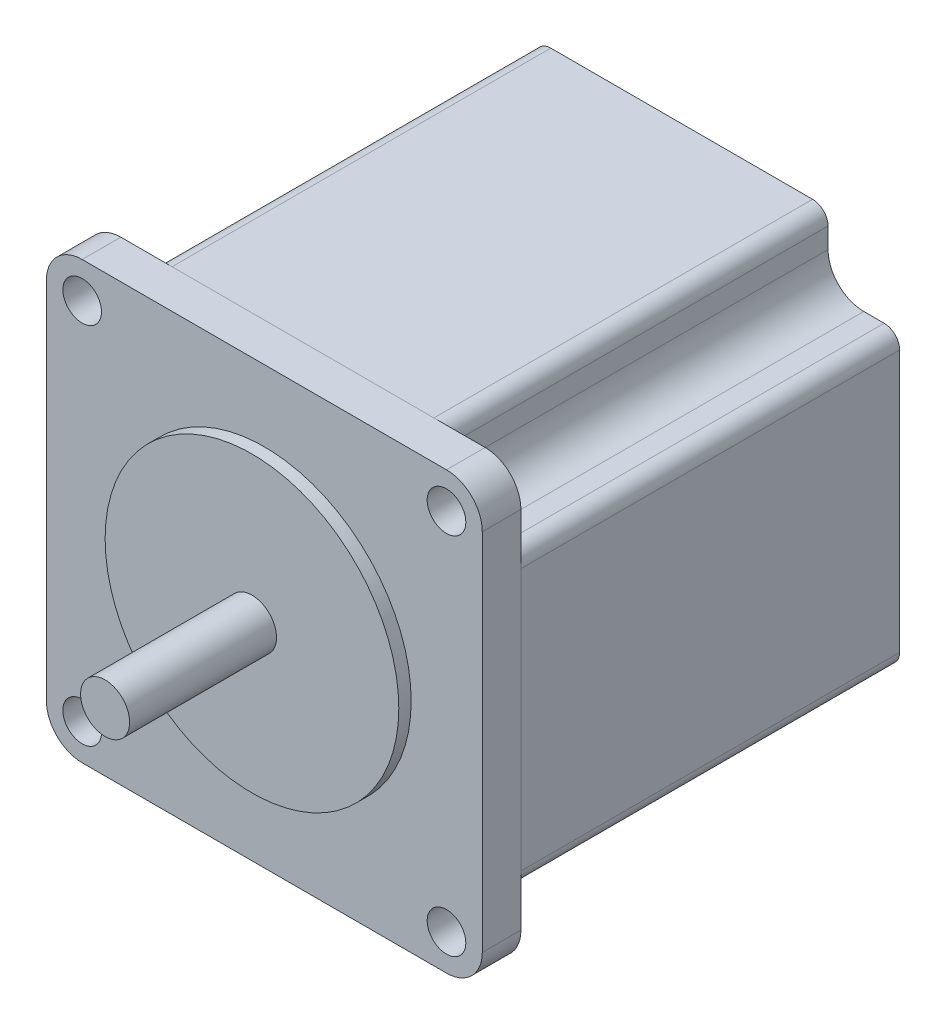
from build123d import *

# Parameters (mm, degrees)
SKETCH1_R           = 2.5
BOSS_EXTRUDE1_DEPTH = 5
SKETCH2_R           = 19
BOSS_EXTRUDE2_DEPTH = 1.6
SKETCH3_R           = 3.175
BOSS_EXTRUDE3_DEPTH = 19
BOSS_EXTRUDE4_DEPTH = 49


with BuildPart() as part:
    # Sketch1 → Boss-Extrude1 (new body)
    with BuildSketch(Plane.XY):
        with BuildLine():
            Line((23.57, 28.2), (-23.57, 28.2))
            ThreePointArc((-23.57, 28.2), (-26.843904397, 26.843904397), (-28.2, 23.57))
            Line((-28.2, 23.57), (-28.2, -23.57))
            ThreePointArc((-28.2, -23.57), (-26.843904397, -26.843904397), (-23.57, -28.2))
            Line((-23.57, -28.2), (23.57, -28.2))
            ThreePointArc((23.57, -28.2), (26.843904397, -26.843904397), (28.2, -23.57))
            Line((28.2, -23.57), (28.2, 23.57))
            ThreePointArc((28.2, 23.57), (26.843904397, 26.843904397), (23.57, 28.2))
        make_face()
        with Locations((-23.57, -23.57)):
            Circle(SKETCH1_R, mode=Mode.SUBTRACT)
        with Locations((-23.57, 23.57)):
            Circle(SKETCH1_R, mode=Mode.SUBTRACT)
        with Locations((23.57, 23.57)):
            Circle(SKETCH1_R, mode=Mode.SUBTRACT)
        with Locations((23.57, -23.57)):
            Circle(SKETCH1_R, mode=Mode.SUBTRACT)
    extrude(amount=-BOSS_EXTRUDE1_DEPTH)

    # Sketch2 → Boss-Extrude2 (add)
    with BuildSketch(Plane.XY):
        Circle(SKETCH2_R)
    extrude(amount=BOSS_EXTRUDE2_DEPTH)

    # Sketch3 → Boss-Extrude3 (add)
    with BuildSketch(Plane.XY.offset(1.6)):
        Circle(SKETCH3_R)
    extrude(amount=BOSS_EXTRUDE3_DEPTH)


with BuildPart() as body_2:
    # Sketch5 → Boss-Extrude4 (new body)
    with BuildSketch(Plane(origin=(0, 0, -5), x_dir=(-1, 0, 0), z_dir=(0, 0, -1))):
        with BuildLine():
            Line((-18.94, -23.57), (-18.94, -26.2))
            ThreePointArc((-18.94, -26.2), (-18.354213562, -27.614213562), (-16.94, -28.2))
            Line((-16.94, -28.2), (16.94, -28.2))
            ThreePointArc((16.94, -28.2), (18.354213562, -27.614213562), (18.94, -26.2))
            Line((18.94, -26.2), (18.94, -23.57))
            ThreePointArc((18.94, -23.57), (20.296095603, -20.296095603), (23.57, -18.94))
            Line((23.57, -18.94), (26.2, -18.94))
            ThreePointArc((26.2, -18.94), (27.614213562, -18.354213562), (28.2, -16.94))
            Line((28.2, -16.94), (28.2, 16.94))
            ThreePointArc((28.2, 16.94), (27.614213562, 18.354213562), (26.2, 18.94))
            Line((26.2, 18.94), (23.57, 18.94))
            ThreePointArc((23.57, 18.94), (20.296095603, 20.296095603), (18.94, 23.57))
            Line((18.94, 23.57), (18.94, 26.2))
            ThreePointArc((18.94, 26.2), (18.354213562, 27.614213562), (16.94, 28.2))
            Line((16.94, 28.2), (-16.94, 28.2))
            ThreePointArc((-16.94, 28.2), (-18.354213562, 27.614213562), (-18.94, 26.2))
            Line((-18.94, 26.2), (-18.94, 23.57))
            ThreePointArc((-18.94, 23.57), (-20.296095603, 20.296095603), (-23.57, 18.94))
            Line((-23.57, 18.94), (-26.2, 18.94))
            ThreePointArc((-26.2, 18.94), (-27.614213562, 18.354213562), (-28.2, 16.94))
            Line((-28.2, 16.94), (-28.2, -16.94))
            ThreePointArc((-28.2, -16.94), (-27.614213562, -18.354213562), (-26.2, -18.94))
            Line((-26.2, -18.94), (-23.57, -18.94))
            ThreePointArc((-23.57, -18.94), (-20.296095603, -20.296095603), (-18.94, -23.57))
        make_face()
    extrude(amount=BOSS_EXTRUDE4_DEPTH)


solid = Compound([part.part, body_2.part])
